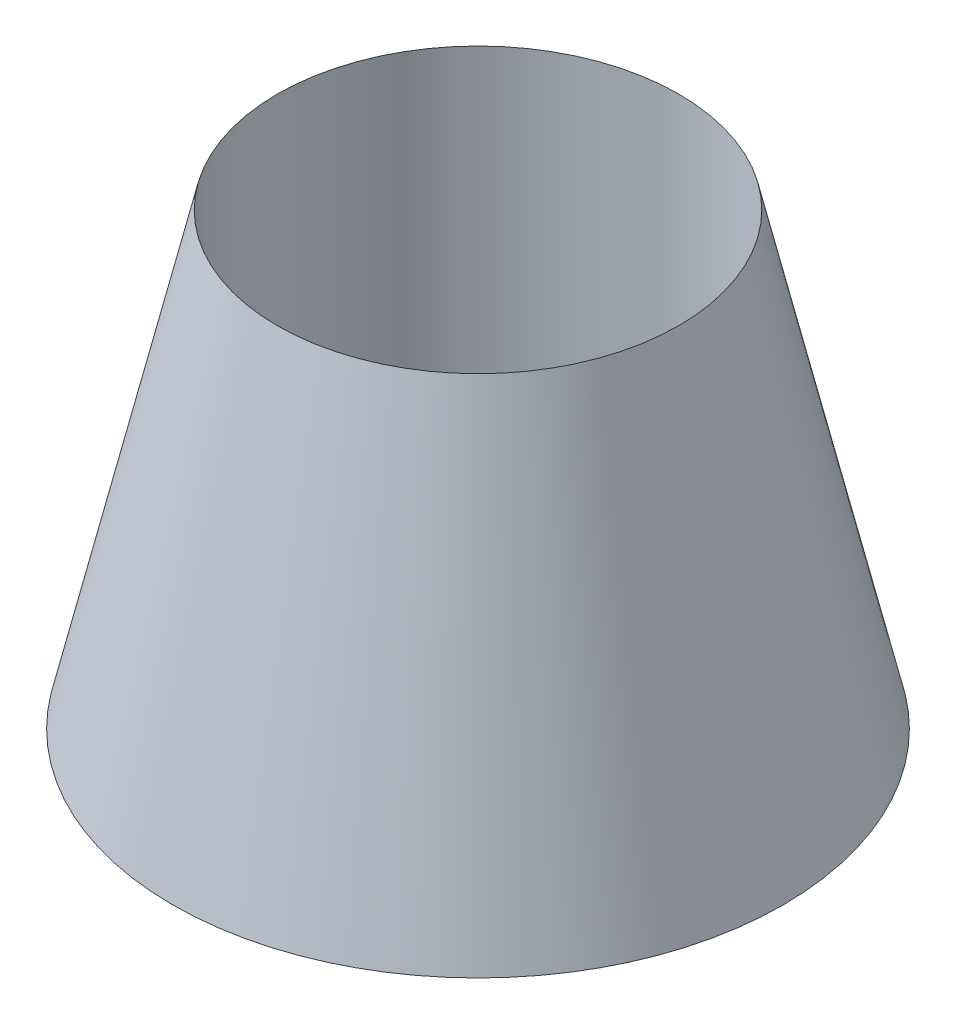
ISO-10303-21;
HEADER;
FILE_DESCRIPTION(('STEP AP214'),'2;1');
FILE_NAME('part.step','',(''),(''),'','','');
FILE_SCHEMA(('AUTOMOTIVE_DESIGN { 1 0 10303 214 1 1 1 1 }'));
ENDSEC;
DATA;
#1=APPLICATION_CONTEXT('core data for automotive mechanical design processes');
#2=APPLICATION_PROTOCOL_DEFINITION('international standard','automotive_design',2000,#1);
#3=PRODUCT_CONTEXT('',#1,'mechanical');
#4=PRODUCT('Part','Part','',(#3));
#5=PRODUCT_RELATED_PRODUCT_CATEGORY('part','',(#4));
#6=PRODUCT_DEFINITION_FORMATION('','',#4);
#7=PRODUCT_DEFINITION_CONTEXT('part definition',#1,'design');
#8=PRODUCT_DEFINITION('design','',#6,#7);
#9=PRODUCT_DEFINITION_SHAPE('','',#8);
#10=(LENGTH_UNIT() NAMED_UNIT(*) SI_UNIT(.MILLI.,.METRE.));
#11=(NAMED_UNIT(*) PLANE_ANGLE_UNIT() SI_UNIT($,.RADIAN.));
#12=(NAMED_UNIT(*) SI_UNIT($,.STERADIAN.) SOLID_ANGLE_UNIT());
#13=UNCERTAINTY_MEASURE_WITH_UNIT(LENGTH_MEASURE(1.E-05),#10,'distance_accuracy_value','');
#14=(GEOMETRIC_REPRESENTATION_CONTEXT(3) GLOBAL_UNCERTAINTY_ASSIGNED_CONTEXT((#13)) GLOBAL_UNIT_ASSIGNED_CONTEXT((#10,
#11,#12)) REPRESENTATION_CONTEXT('',''));
#15=CARTESIAN_POINT('',(0.,0.,0.));
#16=DIRECTION('',(0.,0.,1.));
#17=DIRECTION('',(1.,0.,0.));
#18=AXIS2_PLACEMENT_3D('',#15,#16,#17);
#19=CARTESIAN_POINT('',(0.,0.,0.));
#20=DIRECTION('',(0.,-1.,0.));
#21=DIRECTION('',(0.,0.,-1.));
#22=AXIS2_PLACEMENT_3D('',#19,#20,#21);
#23=CONICAL_SURFACE('',#22,2.413,0.228102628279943);
#24=CARTESIAN_POINT('',(0.,3.55599999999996,0.));
#25=DIRECTION('',(0.,-1.,0.));
#26=DIRECTION('',(0.,0.,-1.));
#27=AXIS2_PLACEMENT_3D('',#24,#25,#26);
#28=CIRCLE('',#27,1.5875);
#29=CARTESIAN_POINT('',(0.,3.55599999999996,-1.5875));
#30=VERTEX_POINT('',#29);
#31=EDGE_CURVE('E10',#30,#30,#28,.T.);
#32=ORIENTED_EDGE('',*,*,#31,.T.);
#33=EDGE_LOOP('',(#32));
#34=FACE_BOUND('',#33,.T.);
#35=CARTESIAN_POINT('',(0.,0.,0.));
#36=DIRECTION('',(0.,-1.,0.));
#37=DIRECTION('',(0.,0.,-1.));
#38=AXIS2_PLACEMENT_3D('',#35,#36,#37);
#39=CIRCLE('',#38,2.413);
#40=CARTESIAN_POINT('',(0.,0.,-2.413));
#41=VERTEX_POINT('',#40);
#42=EDGE_CURVE('E42',#41,#41,#39,.T.);
#43=ORIENTED_EDGE('',*,*,#42,.F.);
#44=EDGE_LOOP('',(#43));
#45=FACE_BOUND('',#44,.T.);
#46=ADVANCED_FACE('F32',(#34,#45),#23,.T.);
#47=CARTESIAN_POINT('',(0.,0.,0.));
#48=DIRECTION('',(0.,-1.,0.));
#49=DIRECTION('',(0.,0.,-1.));
#50=AXIS2_PLACEMENT_3D('',#47,#48,#49);
#51=CYLINDRICAL_SURFACE('',#50,1.5875);
#52=CARTESIAN_POINT('',(0.,0.,0.));
#53=DIRECTION('',(0.,-1.,0.));
#54=DIRECTION('',(0.,0.,-1.));
#55=AXIS2_PLACEMENT_3D('',#52,#53,#54);
#56=CIRCLE('',#55,1.5875);
#57=CARTESIAN_POINT('',(0.,0.,-1.5875));
#58=VERTEX_POINT('',#57);
#59=EDGE_CURVE('E38',#58,#58,#56,.T.);
#60=ORIENTED_EDGE('',*,*,#59,.T.);
#61=EDGE_LOOP('',(#60));
#62=FACE_BOUND('',#61,.T.);
#63=ORIENTED_EDGE('',*,*,#31,.F.);
#64=EDGE_LOOP('',(#63));
#65=FACE_BOUND('',#64,.T.);
#66=ADVANCED_FACE('F53',(#62,#65),#51,.F.);
#67=CARTESIAN_POINT('',(0.,0.,-1.5875));
#68=DIRECTION('',(0.,-1.,0.));
#69=DIRECTION('',(0.,0.,-1.));
#70=AXIS2_PLACEMENT_3D('',#67,#68,#69);
#71=PLANE('',#70);
#72=ORIENTED_EDGE('',*,*,#42,.T.);
#73=EDGE_LOOP('',(#72));
#74=FACE_BOUND('',#73,.T.);
#75=ORIENTED_EDGE('',*,*,#59,.F.);
#76=EDGE_LOOP('',(#75));
#77=FACE_BOUND('',#76,.T.);
#78=ADVANCED_FACE('F49',(#74,#77),#71,.T.);
#79=CLOSED_SHELL('',(#46,#66,#78));
#80=MANIFOLD_SOLID_BREP('B2',#79);
#81=ADVANCED_BREP_SHAPE_REPRESENTATION('',(#18,#80),#14);
#82=SHAPE_DEFINITION_REPRESENTATION(#9,#81);
ENDSEC;
END-ISO-10303-21;
